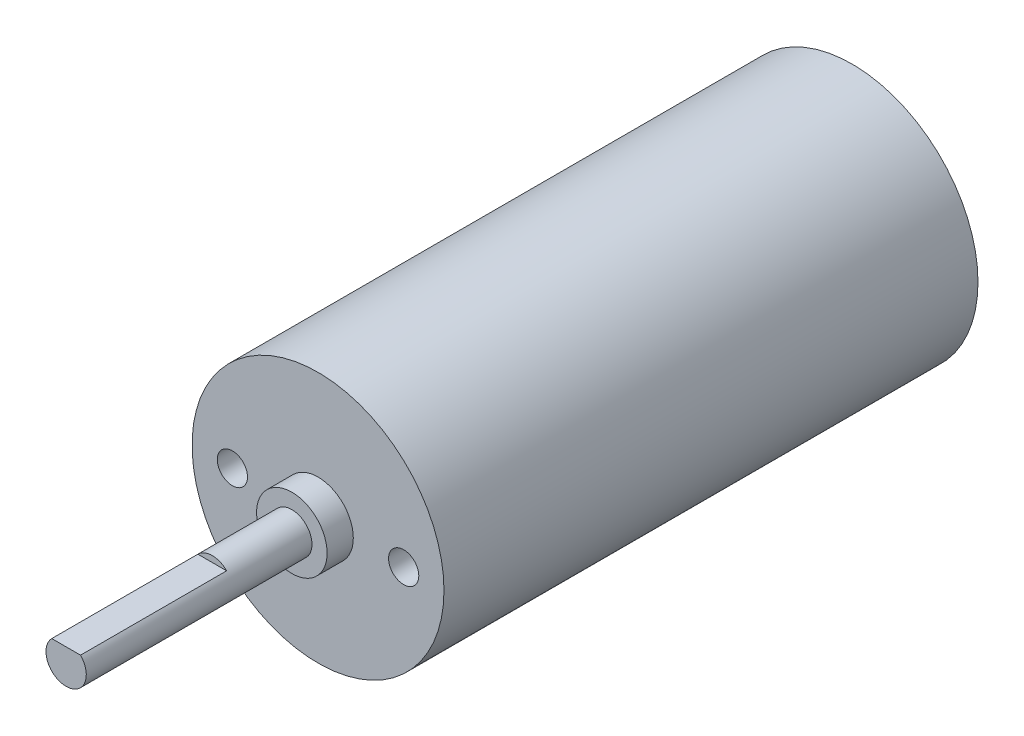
ISO-10303-21;
HEADER;
FILE_DESCRIPTION(('STEP AP214'),'2;1');
FILE_NAME('part.step','',(''),(''),'','','');
FILE_SCHEMA(('AUTOMOTIVE_DESIGN { 1 0 10303 214 1 1 1 1 }'));
ENDSEC;
DATA;
#1=APPLICATION_CONTEXT('core data for automotive mechanical design processes');
#2=APPLICATION_PROTOCOL_DEFINITION('international standard','automotive_design',2000,#1);
#3=PRODUCT_CONTEXT('',#1,'mechanical');
#4=PRODUCT('Part','Part','',(#3));
#5=PRODUCT_RELATED_PRODUCT_CATEGORY('part','',(#4));
#6=PRODUCT_DEFINITION_FORMATION('','',#4);
#7=PRODUCT_DEFINITION_CONTEXT('part definition',#1,'design');
#8=PRODUCT_DEFINITION('design','',#6,#7);
#9=PRODUCT_DEFINITION_SHAPE('','',#8);
#10=(LENGTH_UNIT() NAMED_UNIT(*) SI_UNIT(.MILLI.,.METRE.));
#11=(NAMED_UNIT(*) PLANE_ANGLE_UNIT() SI_UNIT($,.RADIAN.));
#12=(NAMED_UNIT(*) SI_UNIT($,.STERADIAN.) SOLID_ANGLE_UNIT());
#13=UNCERTAINTY_MEASURE_WITH_UNIT(LENGTH_MEASURE(1.E-05),#10,'distance_accuracy_value','');
#14=(GEOMETRIC_REPRESENTATION_CONTEXT(3) GLOBAL_UNCERTAINTY_ASSIGNED_CONTEXT((#13)) GLOBAL_UNIT_ASSIGNED_CONTEXT((#10,
#11,#12)) REPRESENTATION_CONTEXT('',''));
#15=CARTESIAN_POINT('',(0.,0.,0.));
#16=DIRECTION('',(0.,0.,1.));
#17=DIRECTION('',(1.,0.,0.));
#18=AXIS2_PLACEMENT_3D('',#15,#16,#17);
#19=CARTESIAN_POINT('',(0.,0.,0.));
#20=DIRECTION('',(0.,0.,1.));
#21=DIRECTION('',(1.,0.,0.));
#22=AXIS2_PLACEMENT_3D('',#19,#20,#21);
#23=PLANE('',#22);
#24=CARTESIAN_POINT('',(-8.5,0.,0.));
#25=DIRECTION('',(0.,0.,1.));
#26=DIRECTION('',(1.,0.,0.));
#27=AXIS2_PLACEMENT_3D('',#24,#25,#26);
#28=CIRCLE('',#27,1.5);
#29=CARTESIAN_POINT('',(-7.,0.,0.));
#30=VERTEX_POINT('',#29);
#31=EDGE_CURVE('E82',#30,#30,#28,.T.);
#32=ORIENTED_EDGE('',*,*,#31,.F.);
#33=EDGE_LOOP('',(#32));
#34=FACE_BOUND('',#33,.T.);
#35=CARTESIAN_POINT('',(8.5,0.,0.));
#36=DIRECTION('',(0.,0.,1.));
#37=DIRECTION('',(1.,0.,0.));
#38=AXIS2_PLACEMENT_3D('',#35,#36,#37);
#39=CIRCLE('',#38,1.5);
#40=CARTESIAN_POINT('',(10.,0.,0.));
#41=VERTEX_POINT('',#40);
#42=EDGE_CURVE('E94',#41,#41,#39,.T.);
#43=ORIENTED_EDGE('',*,*,#42,.F.);
#44=EDGE_LOOP('',(#43));
#45=FACE_BOUND('',#44,.T.);
#46=CARTESIAN_POINT('',(0.,0.,0.));
#47=DIRECTION('',(0.,0.,1.));
#48=DIRECTION('',(1.,0.,0.));
#49=AXIS2_PLACEMENT_3D('',#46,#47,#48);
#50=CIRCLE('',#49,12.5);
#51=CARTESIAN_POINT('',(12.5,0.,0.));
#52=VERTEX_POINT('',#51);
#53=EDGE_CURVE('E115',#52,#52,#50,.T.);
#54=ORIENTED_EDGE('',*,*,#53,.T.);
#55=EDGE_LOOP('',(#54));
#56=FACE_BOUND('',#55,.T.);
#57=CARTESIAN_POINT('',(0.,0.,0.));
#58=DIRECTION('',(0.,0.,1.));
#59=DIRECTION('',(1.,0.,0.));
#60=AXIS2_PLACEMENT_3D('',#57,#58,#59);
#61=CIRCLE('',#60,3.5);
#62=CARTESIAN_POINT('',(3.5,0.,0.));
#63=VERTEX_POINT('',#62);
#64=EDGE_CURVE('E100',#63,#63,#61,.T.);
#65=ORIENTED_EDGE('',*,*,#64,.F.);
#66=EDGE_LOOP('',(#65));
#67=FACE_BOUND('',#66,.T.);
#68=ADVANCED_FACE('F34',(#34,#45,#56,#67),#23,.T.);
#69=CARTESIAN_POINT('',(0.,0.,-53.));
#70=DIRECTION('',(0.,0.,1.));
#71=DIRECTION('',(1.,0.,0.));
#72=AXIS2_PLACEMENT_3D('',#69,#70,#71);
#73=CYLINDRICAL_SURFACE('',#72,12.5);
#74=CARTESIAN_POINT('',(0.,0.,-53.));
#75=DIRECTION('',(0.,0.,1.));
#76=DIRECTION('',(1.,0.,0.));
#77=AXIS2_PLACEMENT_3D('',#74,#75,#76);
#78=CIRCLE('',#77,12.5);
#79=CARTESIAN_POINT('',(12.5,0.,-53.));
#80=VERTEX_POINT('',#79);
#81=EDGE_CURVE('E116',#80,#80,#78,.T.);
#82=ORIENTED_EDGE('',*,*,#81,.T.);
#83=EDGE_LOOP('',(#82));
#84=FACE_BOUND('',#83,.T.);
#85=ORIENTED_EDGE('',*,*,#53,.F.);
#86=EDGE_LOOP('',(#85));
#87=FACE_BOUND('',#86,.T.);
#88=ADVANCED_FACE('F36',(#84,#87),#73,.T.);
#89=CARTESIAN_POINT('',(0.,0.,-53.));
#90=DIRECTION('',(0.,0.,1.));
#91=DIRECTION('',(1.,0.,0.));
#92=AXIS2_PLACEMENT_3D('',#89,#90,#91);
#93=PLANE('',#92);
#94=ORIENTED_EDGE('',*,*,#81,.F.);
#95=EDGE_LOOP('',(#94));
#96=FACE_BOUND('',#95,.T.);
#97=ADVANCED_FACE('F145',(#96),#93,.F.);
#98=CARTESIAN_POINT('',(0.,0.,2.6));
#99=DIRECTION('',(0.,0.,1.));
#100=DIRECTION('',(1.,0.,0.));
#101=AXIS2_PLACEMENT_3D('',#98,#99,#100);
#102=PLANE('',#101);
#103=CARTESIAN_POINT('',(0.,0.,2.6));
#104=DIRECTION('',(0.,0.,1.));
#105=DIRECTION('',(1.,0.,0.));
#106=AXIS2_PLACEMENT_3D('',#103,#104,#105);
#107=CIRCLE('',#106,3.5);
#108=CARTESIAN_POINT('',(3.5,0.,2.6));
#109=VERTEX_POINT('',#108);
#110=EDGE_CURVE('E101',#109,#109,#107,.T.);
#111=ORIENTED_EDGE('',*,*,#110,.T.);
#112=EDGE_LOOP('',(#111));
#113=FACE_BOUND('',#112,.T.);
#114=CARTESIAN_POINT('',(0.,0.,2.6));
#115=DIRECTION('',(0.,0.,1.));
#116=DIRECTION('',(1.,0.,0.));
#117=AXIS2_PLACEMENT_3D('',#114,#115,#116);
#118=CIRCLE('',#117,2.);
#119=CARTESIAN_POINT('',(2.,0.,2.6));
#120=VERTEX_POINT('',#119);
#121=EDGE_CURVE('E97',#120,#120,#118,.T.);
#122=ORIENTED_EDGE('',*,*,#121,.F.);
#123=EDGE_LOOP('',(#122));
#124=FACE_BOUND('',#123,.T.);
#125=ADVANCED_FACE('F136',(#113,#124),#102,.T.);
#126=CARTESIAN_POINT('',(0.,0.,2.6));
#127=DIRECTION('',(0.,0.,-1.));
#128=DIRECTION('',(-1.,0.,0.));
#129=AXIS2_PLACEMENT_3D('',#126,#127,#128);
#130=CYLINDRICAL_SURFACE('',#129,3.5);
#131=ORIENTED_EDGE('',*,*,#110,.F.);
#132=EDGE_LOOP('',(#131));
#133=FACE_BOUND('',#132,.T.);
#134=ORIENTED_EDGE('',*,*,#64,.T.);
#135=EDGE_LOOP('',(#134));
#136=FACE_BOUND('',#135,.T.);
#137=ADVANCED_FACE('F129',(#133,#136),#130,.T.);
#138=CARTESIAN_POINT('',(122.673470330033,1.4,10.5));
#139=DIRECTION('',(0.,0.,1.));
#140=DIRECTION('',(1.,0.,0.));
#141=AXIS2_PLACEMENT_3D('',#138,#139,#140);
#142=PLANE('',#141);
#143=DIRECTION('',(-1.,0.,0.));
#144=VECTOR('',#143,1.);
#145=CARTESIAN_POINT('',(122.673470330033,1.4,10.5));
#146=LINE('',#145,#144);
#147=CARTESIAN_POINT('',(1.42828568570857,1.4,10.5));
#148=VERTEX_POINT('',#147);
#149=CARTESIAN_POINT('',(-1.42828568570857,1.4,10.5));
#150=VERTEX_POINT('',#149);
#151=EDGE_CURVE('E104',#148,#150,#146,.T.);
#152=ORIENTED_EDGE('',*,*,#151,.F.);
#153=CARTESIAN_POINT('',(0.,0.,10.5));
#154=DIRECTION('',(0.,0.,1.));
#155=DIRECTION('',(1.,0.,0.));
#156=AXIS2_PLACEMENT_3D('',#153,#154,#155);
#157=CIRCLE('',#156,2.);
#158=EDGE_CURVE('E11',#148,#150,#157,.T.);
#159=ORIENTED_EDGE('',*,*,#158,.T.);
#160=EDGE_LOOP('',(#152,#159));
#161=FACE_BOUND('',#160,.T.);
#162=ADVANCED_FACE('F127',(#161),#142,.T.);
#163=CARTESIAN_POINT('',(0.,0.,25.));
#164=DIRECTION('',(0.,0.,1.));
#165=DIRECTION('',(1.,0.,0.));
#166=AXIS2_PLACEMENT_3D('',#163,#164,#165);
#167=PLANE('',#166);
#168=CARTESIAN_POINT('',(0.,0.,25.));
#169=DIRECTION('',(0.,0.,1.));
#170=DIRECTION('',(1.,0.,0.));
#171=AXIS2_PLACEMENT_3D('',#168,#169,#170);
#172=CIRCLE('',#171,2.);
#173=CARTESIAN_POINT('',(-1.42828568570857,1.4,25.));
#174=VERTEX_POINT('',#173);
#175=CARTESIAN_POINT('',(1.42828568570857,1.4,25.));
#176=VERTEX_POINT('',#175);
#177=EDGE_CURVE('E112',#174,#176,#172,.T.);
#178=ORIENTED_EDGE('',*,*,#177,.T.);
#179=DIRECTION('',(-1.,0.,0.));
#180=VECTOR('',#179,1.);
#181=CARTESIAN_POINT('',(0.,1.4,25.));
#182=LINE('',#181,#180);
#183=EDGE_CURVE('E42',#176,#174,#182,.T.);
#184=ORIENTED_EDGE('',*,*,#183,.T.);
#185=EDGE_LOOP('',(#178,#184));
#186=FACE_BOUND('',#185,.T.);
#187=ADVANCED_FACE('F122',(#186),#167,.T.);
#188=CARTESIAN_POINT('',(122.673470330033,1.4,25.));
#189=DIRECTION('',(0.,1.,0.));
#190=DIRECTION('',(0.,0.,1.));
#191=AXIS2_PLACEMENT_3D('',#188,#189,#190);
#192=PLANE('',#191);
#193=ORIENTED_EDGE('',*,*,#183,.F.);
#194=DIRECTION('',(0.,0.,-1.));
#195=VECTOR('',#194,1.);
#196=CARTESIAN_POINT('',(1.42828568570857,1.4,25.));
#197=LINE('',#196,#195);
#198=EDGE_CURVE('E109',#176,#148,#197,.T.);
#199=ORIENTED_EDGE('',*,*,#198,.T.);
#200=ORIENTED_EDGE('',*,*,#151,.T.);
#201=DIRECTION('',(0.,0.,-1.));
#202=VECTOR('',#201,1.);
#203=CARTESIAN_POINT('',(-1.42828568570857,1.4,25.));
#204=LINE('',#203,#202);
#205=EDGE_CURVE('E49',#150,#174,#204,.F.);
#206=ORIENTED_EDGE('',*,*,#205,.T.);
#207=EDGE_LOOP('',(#193,#199,#200,#206));
#208=FACE_BOUND('',#207,.T.);
#209=ADVANCED_FACE('F126',(#208),#192,.T.);
#210=CARTESIAN_POINT('',(0.,0.,25.));
#211=DIRECTION('',(0.,0.,-1.));
#212=DIRECTION('',(-1.,0.,0.));
#213=AXIS2_PLACEMENT_3D('',#210,#211,#212);
#214=CYLINDRICAL_SURFACE('',#213,2.);
#215=ORIENTED_EDGE('',*,*,#121,.T.);
#216=EDGE_LOOP('',(#215));
#217=FACE_BOUND('',#216,.T.);
#218=ORIENTED_EDGE('',*,*,#198,.F.);
#219=ORIENTED_EDGE('',*,*,#177,.F.);
#220=ORIENTED_EDGE('',*,*,#205,.F.);
#221=ORIENTED_EDGE('',*,*,#158,.F.);
#222=EDGE_LOOP('',(#218,#219,#220,#221));
#223=FACE_BOUND('',#222,.T.);
#224=ADVANCED_FACE('F125',(#217,#223),#214,.T.);
#225=CARTESIAN_POINT('',(8.5,0.,0.));
#226=DIRECTION('',(0.,0.,1.));
#227=DIRECTION('',(1.,0.,0.));
#228=AXIS2_PLACEMENT_3D('',#225,#226,#227);
#229=CYLINDRICAL_SURFACE('',#228,1.5);
#230=CARTESIAN_POINT('',(8.5,0.,-6.));
#231=DIRECTION('',(0.,0.,1.));
#232=DIRECTION('',(1.,0.,0.));
#233=AXIS2_PLACEMENT_3D('',#230,#231,#232);
#234=CIRCLE('',#233,1.5);
#235=CARTESIAN_POINT('',(10.,0.,-6.));
#236=VERTEX_POINT('',#235);
#237=EDGE_CURVE('E91',#236,#236,#234,.T.);
#238=ORIENTED_EDGE('',*,*,#237,.F.);
#239=EDGE_LOOP('',(#238));
#240=FACE_BOUND('',#239,.T.);
#241=ORIENTED_EDGE('',*,*,#42,.T.);
#242=EDGE_LOOP('',(#241));
#243=FACE_BOUND('',#242,.T.);
#244=ADVANCED_FACE('F154',(#240,#243),#229,.F.);
#245=CARTESIAN_POINT('',(9.75,0.,-6.));
#246=DIRECTION('',(0.,0.,-1.));
#247=DIRECTION('',(-1.,0.,0.));
#248=AXIS2_PLACEMENT_3D('',#245,#246,#247);
#249=PLANE('',#248);
#250=CARTESIAN_POINT('',(8.5,0.,-6.));
#251=DIRECTION('',(0.,0.,1.));
#252=DIRECTION('',(1.,0.,0.));
#253=AXIS2_PLACEMENT_3D('',#250,#251,#252);
#254=CIRCLE('',#253,1.25);
#255=CARTESIAN_POINT('',(9.75,0.,-6.));
#256=VERTEX_POINT('',#255);
#257=EDGE_CURVE('E88',#256,#256,#254,.T.);
#258=ORIENTED_EDGE('',*,*,#257,.F.);
#259=EDGE_LOOP('',(#258));
#260=FACE_BOUND('',#259,.T.);
#261=ORIENTED_EDGE('',*,*,#237,.T.);
#262=EDGE_LOOP('',(#261));
#263=FACE_BOUND('',#262,.T.);
#264=ADVANCED_FACE('F173',(#260,#263),#249,.F.);
#265=CARTESIAN_POINT('',(8.5,0.,0.));
#266=DIRECTION('',(0.,0.,1.));
#267=DIRECTION('',(1.,0.,0.));
#268=AXIS2_PLACEMENT_3D('',#265,#266,#267);
#269=CYLINDRICAL_SURFACE('',#268,1.25);
#270=CARTESIAN_POINT('',(8.5,0.,-7.5));
#271=DIRECTION('',(0.,0.,1.));
#272=DIRECTION('',(1.,0.,0.));
#273=AXIS2_PLACEMENT_3D('',#270,#271,#272);
#274=CIRCLE('',#273,1.25);
#275=CARTESIAN_POINT('',(9.75,0.,-7.5));
#276=VERTEX_POINT('',#275);
#277=EDGE_CURVE('E85',#276,#276,#274,.T.);
#278=ORIENTED_EDGE('',*,*,#277,.F.);
#279=EDGE_LOOP('',(#278));
#280=FACE_BOUND('',#279,.T.);
#281=ORIENTED_EDGE('',*,*,#257,.T.);
#282=EDGE_LOOP('',(#281));
#283=FACE_BOUND('',#282,.T.);
#284=ADVANCED_FACE('F181',(#280,#283),#269,.F.);
#285=CARTESIAN_POINT('',(8.5,0.,-7.5));
#286=DIRECTION('',(0.,0.,1.));
#287=DIRECTION('',(1.,0.,0.));
#288=AXIS2_PLACEMENT_3D('',#285,#286,#287);
#289=CONICAL_SURFACE('',#288,1.25,1.02974425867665);
#290=CARTESIAN_POINT('',(8.5,0.,-8.25107577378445));
#291=VERTEX_POINT('',#290);
#292=VERTEX_LOOP('',#291);
#293=FACE_BOUND('',#292,.T.);
#294=ORIENTED_EDGE('',*,*,#277,.T.);
#295=EDGE_LOOP('',(#294));
#296=FACE_BOUND('',#295,.T.);
#297=ADVANCED_FACE('F189',(#293,#296),#289,.F.);
#298=CARTESIAN_POINT('',(-8.5,0.,0.));
#299=DIRECTION('',(0.,0.,1.));
#300=DIRECTION('',(1.,0.,0.));
#301=AXIS2_PLACEMENT_3D('',#298,#299,#300);
#302=CYLINDRICAL_SURFACE('',#301,1.5);
#303=CARTESIAN_POINT('',(-8.5,0.,-6.));
#304=DIRECTION('',(0.,0.,1.));
#305=DIRECTION('',(1.,0.,0.));
#306=AXIS2_PLACEMENT_3D('',#303,#304,#305);
#307=CIRCLE('',#306,1.5);
#308=CARTESIAN_POINT('',(-7.,0.,-6.));
#309=VERTEX_POINT('',#308);
#310=EDGE_CURVE('E77',#309,#309,#307,.T.);
#311=ORIENTED_EDGE('',*,*,#310,.F.);
#312=EDGE_LOOP('',(#311));
#313=FACE_BOUND('',#312,.T.);
#314=ORIENTED_EDGE('',*,*,#31,.T.);
#315=EDGE_LOOP('',(#314));
#316=FACE_BOUND('',#315,.T.);
#317=ADVANCED_FACE('F197',(#313,#316),#302,.F.);
#318=CARTESIAN_POINT('',(-7.25,0.,-6.));
#319=DIRECTION('',(0.,0.,-1.));
#320=DIRECTION('',(-1.,0.,0.));
#321=AXIS2_PLACEMENT_3D('',#318,#319,#320);
#322=PLANE('',#321);
#323=CARTESIAN_POINT('',(-8.5,0.,-6.));
#324=DIRECTION('',(0.,0.,1.));
#325=DIRECTION('',(1.,0.,0.));
#326=AXIS2_PLACEMENT_3D('',#323,#324,#325);
#327=CIRCLE('',#326,1.25);
#328=CARTESIAN_POINT('',(-7.25,0.,-6.));
#329=VERTEX_POINT('',#328);
#330=EDGE_CURVE('E74',#329,#329,#327,.T.);
#331=ORIENTED_EDGE('',*,*,#330,.F.);
#332=EDGE_LOOP('',(#331));
#333=FACE_BOUND('',#332,.T.);
#334=ORIENTED_EDGE('',*,*,#310,.T.);
#335=EDGE_LOOP('',(#334));
#336=FACE_BOUND('',#335,.T.);
#337=ADVANCED_FACE('F205',(#333,#336),#322,.F.);
#338=CARTESIAN_POINT('',(-8.5,0.,0.));
#339=DIRECTION('',(0.,0.,1.));
#340=DIRECTION('',(1.,0.,0.));
#341=AXIS2_PLACEMENT_3D('',#338,#339,#340);
#342=CYLINDRICAL_SURFACE('',#341,1.25);
#343=CARTESIAN_POINT('',(-8.5,0.,-7.5));
#344=DIRECTION('',(0.,0.,1.));
#345=DIRECTION('',(1.,0.,0.));
#346=AXIS2_PLACEMENT_3D('',#343,#344,#345);
#347=CIRCLE('',#346,1.25);
#348=CARTESIAN_POINT('',(-7.25,0.,-7.5));
#349=VERTEX_POINT('',#348);
#350=EDGE_CURVE('E72',#349,#349,#347,.T.);
#351=ORIENTED_EDGE('',*,*,#350,.F.);
#352=EDGE_LOOP('',(#351));
#353=FACE_BOUND('',#352,.T.);
#354=ORIENTED_EDGE('',*,*,#330,.T.);
#355=EDGE_LOOP('',(#354));
#356=FACE_BOUND('',#355,.T.);
#357=ADVANCED_FACE('F68',(#353,#356),#342,.F.);
#358=CARTESIAN_POINT('',(-8.5,0.,-7.5));
#359=DIRECTION('',(0.,0.,1.));
#360=DIRECTION('',(1.,0.,0.));
#361=AXIS2_PLACEMENT_3D('',#358,#359,#360);
#362=CONICAL_SURFACE('',#361,1.25,1.02974425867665);
#363=CARTESIAN_POINT('',(-8.5,0.,-8.25107577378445));
#364=VERTEX_POINT('',#363);
#365=VERTEX_LOOP('',#364);
#366=FACE_BOUND('',#365,.T.);
#367=ORIENTED_EDGE('',*,*,#350,.T.);
#368=EDGE_LOOP('',(#367));
#369=FACE_BOUND('',#368,.T.);
#370=ADVANCED_FACE('F65',(#366,#369),#362,.F.);
#371=CLOSED_SHELL('',(#68,#88,#97,#125,#137,#162,#187,#209,#224,#244,#264,#284,#297,#317,#337,
#357,#370));
#372=MANIFOLD_SOLID_BREP('B2',#371);
#373=ADVANCED_BREP_SHAPE_REPRESENTATION('',(#18,#372),#14);
#374=SHAPE_DEFINITION_REPRESENTATION(#9,#373);
ENDSEC;
END-ISO-10303-21;
